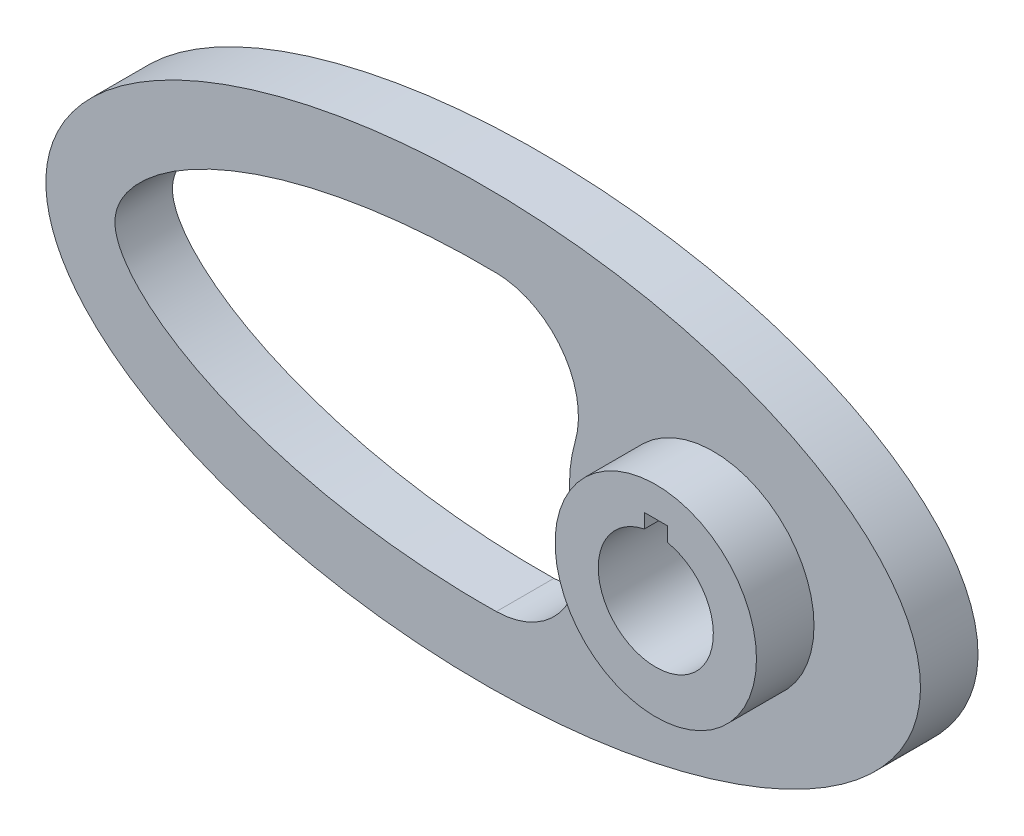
from build123d import *

# Parameters (mm, degrees)
SKETCH1_RX          = 76
SKETCH1_RY          = 37.5
BOSS_EXTRUDE1_DEPTH = 10
SKETCH2_R           = 17.5
BOSS_EXTRUDE2_DEPTH = 10
CUT_EXTRUDE1_DEPTH  = 86.336100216
CUT_EXTRUDE2_DEPTH  = 88.076116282


with BuildPart() as part:
    # Sketch1 → Boss-Extrude1 (new body)
    with BuildSketch(Plane.XY):
        with Locations(Location((0, 0), (0, 0, 180))):
            Ellipse(SKETCH1_RX, SKETCH1_RY)
    extrude(amount=BOSS_EXTRUDE1_DEPTH)

    # Sketch2 → Boss-Extrude2 (add)
    with BuildSketch(Plane.XY.offset(10)):
        with Locations((40, 0)):
            Circle(SKETCH2_R)
    extrude(amount=BOSS_EXTRUDE2_DEPTH)

    # Sketch3 → Cut-Extrude1 (cut, through all)
    with BuildSketch(Plane.XY.offset(10)):
        with BuildLine():
            ThreePointArc((15.98592019, 6.951544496), (15, 3.7e-08), (15.98592017, -6.951544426))
            ThreePointArc((15.98592017, -6.951544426), (13.718784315, -19.601466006), (2.291407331, -25.481557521))
            add(Edge.make_bspline(
                [(2.29138759, 25.481557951), (1.536487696, 25.493722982), (0.781887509, 25.499850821), (-2.981033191, 25.500581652), (-5.984925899, 25.40599226), (-11.983100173, 25.023209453), (-14.977386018, 24.73510222), (-20.95563043, 23.950858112), (-23.939601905, 23.454981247), (-28.406683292, 22.532373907), (-29.89678094, 22.194215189), (-32.857840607, 21.45580248), (-34.328995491, 21.055659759), (-37.25072809, 20.187471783), (-38.70131721, 19.719464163), (-41.57930104, 18.706909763), (-43.008786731, 18.161435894), (-45.820852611, 16.989909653), (-47.205317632, 16.36342386), (-49.923326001, 15.014306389), (-51.256986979, 14.291896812), (-53.860708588, 12.726993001), (-55.131807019, 11.884621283), (-57.583878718, 10.037173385), (-58.749677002, 9.04538051), (-60.362588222, 7.404251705), (-60.876365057, 6.831585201), (-61.825648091, 5.638947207), (-62.26365963, 5.017320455), (-62.842802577, 4.031076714), (-63.022734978, 3.693267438), (-63.349140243, 2.994531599), (-63.494672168, 2.634866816), (-63.735502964, 1.90638021), (-63.831747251, 1.535622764), (-63.964260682, 0.7779445), (-64, 0.389318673), (-64, 0), (-64, -0.778637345), (-63.859069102, -1.530171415), (-63.497163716, -2.628527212), (-63.351411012, -2.989020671), (-63.027073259, -3.684617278), (-62.847612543, -4.022381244), (-62.267637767, -5.011537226), (-61.824495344, -5.641036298), (-60.865057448, -6.845142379), (-60.353939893, -7.413375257), (-58.75112499, -9.043254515), (-57.59094473, -10.031136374), (-55.758025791, -11.413165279), (-55.130622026, -11.856962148), (-53.861474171, -12.706272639), (-53.218031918, -13.113090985), (-51.264821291, -14.287519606), (-49.932355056, -15.009477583), (-47.219389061, -16.356783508), (-45.83877221, -16.981895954), (-43.036850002, -18.150283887), (-41.615494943, -18.693459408), (-38.73690368, -19.707642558), (-37.289143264, -20.175264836), (-32.930023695, -21.47290858), (-29.999989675, -22.199648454), (-24.100467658, -23.425248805), (-21.130888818, -23.923584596), (-15.156309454, -24.715666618), (-12.151276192, -25.009223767), (-7.618397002, -25.30326182), (-6.103199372, -25.376797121), (-3.064360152, -25.475096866), (-1.546314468, -25.499657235), (0.743333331, -25.500170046), (1.517739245, -25.494026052), (2.291407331, -25.481557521)],
                knots=[0.74216518, 0.74216518, 0.74216518, 0.74216518, 0.75, 0.75, 0.78125, 0.78125, 0.8125, 0.8125, 0.84375, 0.84375, 0.859375, 0.859375, 0.875, 0.875, 0.890625, 0.890625, 0.90625, 0.90625, 0.921875, 0.921875, 0.9375, 0.9375, 0.953125, 0.953125, 0.96875, 0.96875, 0.9765625, 0.9765625, 0.984375, 0.984375, 0.98828125, 0.98828125, 0.9921875, 0.9921875, 0.99609375, 0.99609375, 1, 1, 1, 1.0078125, 1.0078125, 1.01171875, 1.01171875, 1.015625, 1.015625, 1.0234375, 1.0234375, 1.03125, 1.03125, 1.046875, 1.046875, 1.0546875, 1.0546875, 1.0625, 1.0625, 1.078125, 1.078125, 1.09375, 1.09375, 1.109375, 1.109375, 1.125, 1.125, 1.15625, 1.15625, 1.1875, 1.1875, 1.21875, 1.21875, 1.234375, 1.234375, 1.25, 1.25, 1.257997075, 1.257997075, 1.257997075, 1.257997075], degree=3))
            ThreePointArc((2.29138759, 25.481557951), (13.718778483, 19.601474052), (15.98592019, 6.951544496))
        make_face()
    extrude(amount=-CUT_EXTRUDE1_DEPTH, mode=Mode.SUBTRACT)

    # Sketch7 → Cut-Extrude2 (cut, through all)
    with BuildSketch(Plane.XY.offset(20)):
        with BuildLine():
            Line((38, 9.797958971), (38, 12.297958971))
            Line((38, 12.297958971), (42, 12.297958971))
            Line((42, 12.297958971), (42, 9.797958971))
            ThreePointArc((42, 9.797958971), (40, -10), (38, 9.797958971))
        make_face()
    extrude(amount=-CUT_EXTRUDE2_DEPTH, mode=Mode.SUBTRACT)


solid = part.part
